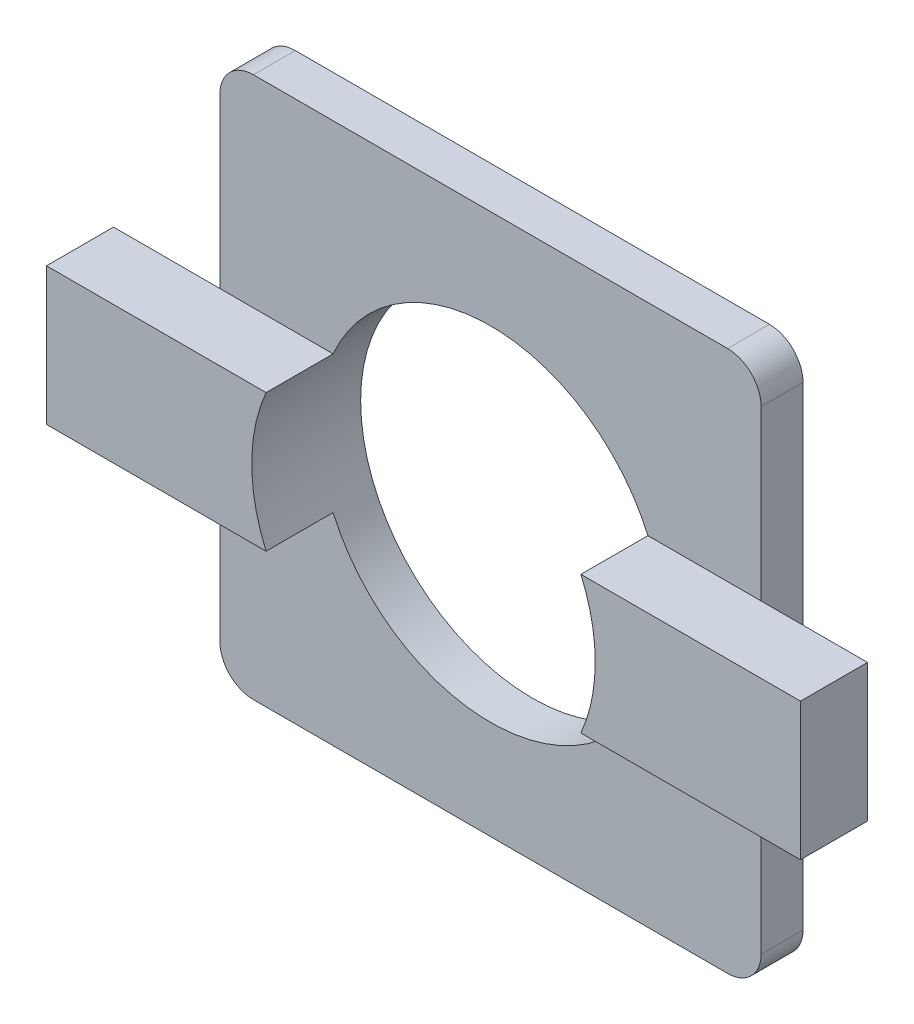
ISO-10303-21;
HEADER;
FILE_DESCRIPTION(('STEP AP214'),'2;1');
FILE_NAME('part.step','',(''),(''),'','','');
FILE_SCHEMA(('AUTOMOTIVE_DESIGN { 1 0 10303 214 1 1 1 1 }'));
ENDSEC;
DATA;
#1=APPLICATION_CONTEXT('core data for automotive mechanical design processes');
#2=APPLICATION_PROTOCOL_DEFINITION('international standard','automotive_design',2000,#1);
#3=PRODUCT_CONTEXT('',#1,'mechanical');
#4=PRODUCT('Part','Part','',(#3));
#5=PRODUCT_RELATED_PRODUCT_CATEGORY('part','',(#4));
#6=PRODUCT_DEFINITION_FORMATION('','',#4);
#7=PRODUCT_DEFINITION_CONTEXT('part definition',#1,'design');
#8=PRODUCT_DEFINITION('design','',#6,#7);
#9=PRODUCT_DEFINITION_SHAPE('','',#8);
#10=(LENGTH_UNIT() NAMED_UNIT(*) SI_UNIT(.MILLI.,.METRE.));
#11=(NAMED_UNIT(*) PLANE_ANGLE_UNIT() SI_UNIT($,.RADIAN.));
#12=(NAMED_UNIT(*) SI_UNIT($,.STERADIAN.) SOLID_ANGLE_UNIT());
#13=UNCERTAINTY_MEASURE_WITH_UNIT(LENGTH_MEASURE(1.E-05),#10,'distance_accuracy_value','');
#14=(GEOMETRIC_REPRESENTATION_CONTEXT(3) GLOBAL_UNCERTAINTY_ASSIGNED_CONTEXT((#13)) GLOBAL_UNIT_ASSIGNED_CONTEXT((#10,
#11,#12)) REPRESENTATION_CONTEXT('',''));
#15=CARTESIAN_POINT('',(0.,0.,0.));
#16=DIRECTION('',(0.,0.,1.));
#17=DIRECTION('',(1.,0.,0.));
#18=AXIS2_PLACEMENT_3D('',#15,#16,#17);
#19=CARTESIAN_POINT('',(22.5,4.1,2.5));
#20=DIRECTION('',(1.,0.,0.));
#21=DIRECTION('',(0.,0.,-1.));
#22=AXIS2_PLACEMENT_3D('',#19,#20,#21);
#23=PLANE('',#22);
#24=DIRECTION('',(0.,1.,0.));
#25=VECTOR('',#24,1.);
#26=CARTESIAN_POINT('',(22.5,0.,2.5));
#27=LINE('',#26,#25);
#28=CARTESIAN_POINT('',(22.5,-4.1,2.5));
#29=VERTEX_POINT('',#28);
#30=CARTESIAN_POINT('',(22.5,4.1,2.5));
#31=VERTEX_POINT('',#30);
#32=EDGE_CURVE('E159',#29,#31,#27,.T.);
#33=ORIENTED_EDGE('',*,*,#32,.T.);
#34=DIRECTION('',(0.,0.,1.));
#35=VECTOR('',#34,1.);
#36=CARTESIAN_POINT('',(22.5,4.1,2.5));
#37=LINE('',#36,#35);
#38=CARTESIAN_POINT('',(22.5,4.1,6.5));
#39=VERTEX_POINT('',#38);
#40=EDGE_CURVE('E147',#39,#31,#37,.F.);
#41=ORIENTED_EDGE('',*,*,#40,.F.);
#42=DIRECTION('',(0.,1.,0.));
#43=VECTOR('',#42,1.);
#44=CARTESIAN_POINT('',(22.5,0.,6.5));
#45=LINE('',#44,#43);
#46=CARTESIAN_POINT('',(22.5,-4.1,6.5));
#47=VERTEX_POINT('',#46);
#48=EDGE_CURVE('E168',#47,#39,#45,.T.);
#49=ORIENTED_EDGE('',*,*,#48,.F.);
#50=DIRECTION('',(0.,0.,-1.));
#51=VECTOR('',#50,1.);
#52=CARTESIAN_POINT('',(22.5,-4.1,2.5));
#53=LINE('',#52,#51);
#54=EDGE_CURVE('E160',#29,#47,#53,.F.);
#55=ORIENTED_EDGE('',*,*,#54,.F.);
#56=EDGE_LOOP('',(#33,#41,#49,#55));
#57=FACE_BOUND('',#56,.T.);
#58=ADVANCED_FACE('F16',(#57),#23,.T.);
#59=CARTESIAN_POINT('',(-22.5,-4.1,2.5));
#60=DIRECTION('',(-1.,0.,0.));
#61=DIRECTION('',(0.,0.,1.));
#62=AXIS2_PLACEMENT_3D('',#59,#60,#61);
#63=PLANE('',#62);
#64=DIRECTION('',(0.,1.,0.));
#65=VECTOR('',#64,1.);
#66=CARTESIAN_POINT('',(-22.5,0.,2.5));
#67=LINE('',#66,#65);
#68=CARTESIAN_POINT('',(-22.5,4.1,2.5));
#69=VERTEX_POINT('',#68);
#70=CARTESIAN_POINT('',(-22.5,-4.1,2.5));
#71=VERTEX_POINT('',#70);
#72=EDGE_CURVE('E161',#69,#71,#67,.F.);
#73=ORIENTED_EDGE('',*,*,#72,.T.);
#74=DIRECTION('',(0.,0.,-1.));
#75=VECTOR('',#74,1.);
#76=CARTESIAN_POINT('',(-22.5,-4.1,2.5));
#77=LINE('',#76,#75);
#78=CARTESIAN_POINT('',(-22.5,-4.1,6.5));
#79=VERTEX_POINT('',#78);
#80=EDGE_CURVE('E255',#79,#71,#77,.T.);
#81=ORIENTED_EDGE('',*,*,#80,.F.);
#82=DIRECTION('',(0.,1.,0.));
#83=VECTOR('',#82,1.);
#84=CARTESIAN_POINT('',(-22.5,0.,6.5));
#85=LINE('',#84,#83);
#86=CARTESIAN_POINT('',(-22.5,4.1,6.5));
#87=VERTEX_POINT('',#86);
#88=EDGE_CURVE('E175',#87,#79,#85,.F.);
#89=ORIENTED_EDGE('',*,*,#88,.F.);
#90=DIRECTION('',(0.,0.,1.));
#91=VECTOR('',#90,1.);
#92=CARTESIAN_POINT('',(-22.5,4.1,2.5));
#93=LINE('',#92,#91);
#94=EDGE_CURVE('E174',#69,#87,#93,.T.);
#95=ORIENTED_EDGE('',*,*,#94,.F.);
#96=EDGE_LOOP('',(#73,#81,#89,#95));
#97=FACE_BOUND('',#96,.T.);
#98=ADVANCED_FACE('F477',(#97),#63,.T.);
#99=CARTESIAN_POINT('',(0.,0.,2.5));
#100=DIRECTION('',(0.,0.,1.));
#101=DIRECTION('',(1.,0.,0.));
#102=AXIS2_PLACEMENT_3D('',#99,#100,#101);
#103=PLANE('',#102);
#104=DIRECTION('',(1.,0.,0.));
#105=VECTOR('',#104,1.);
#106=CARTESIAN_POINT('',(-22.5,4.1,2.5));
#107=LINE('',#106,#105);
#108=CARTESIAN_POINT('',(16.15,4.1,2.5));
#109=VERTEX_POINT('',#108);
#110=EDGE_CURVE('E151',#31,#109,#107,.F.);
#111=ORIENTED_EDGE('',*,*,#110,.F.);
#112=ORIENTED_EDGE('',*,*,#32,.F.);
#113=DIRECTION('',(1.,0.,0.));
#114=VECTOR('',#113,1.);
#115=CARTESIAN_POINT('',(22.5,-4.1,2.5));
#116=LINE('',#115,#114);
#117=CARTESIAN_POINT('',(16.15,-4.1,2.5));
#118=VERTEX_POINT('',#117);
#119=EDGE_CURVE('E115',#118,#29,#116,.T.);
#120=ORIENTED_EDGE('',*,*,#119,.F.);
#121=DIRECTION('',(0.,1.,0.));
#122=VECTOR('',#121,1.);
#123=CARTESIAN_POINT('',(16.15,14.15,2.5));
#124=LINE('',#123,#122);
#125=EDGE_CURVE('E164',#109,#118,#124,.F.);
#126=ORIENTED_EDGE('',*,*,#125,.F.);
#127=EDGE_LOOP('',(#111,#112,#120,#126));
#128=FACE_BOUND('',#127,.T.);
#129=ADVANCED_FACE('F163',(#128),#103,.F.);
#130=CARTESIAN_POINT('',(0.,0.,2.5));
#131=DIRECTION('',(0.,0.,1.));
#132=DIRECTION('',(1.,0.,0.));
#133=AXIS2_PLACEMENT_3D('',#130,#131,#132);
#134=PLANE('',#133);
#135=DIRECTION('',(1.,0.,0.));
#136=VECTOR('',#135,1.);
#137=CARTESIAN_POINT('',(22.5,-4.1,2.5));
#138=LINE('',#137,#136);
#139=CARTESIAN_POINT('',(-16.15,-4.1,2.5));
#140=VERTEX_POINT('',#139);
#141=EDGE_CURVE('E245',#71,#140,#138,.T.);
#142=ORIENTED_EDGE('',*,*,#141,.F.);
#143=ORIENTED_EDGE('',*,*,#72,.F.);
#144=DIRECTION('',(1.,0.,0.));
#145=VECTOR('',#144,1.);
#146=CARTESIAN_POINT('',(-22.5,4.1,2.5));
#147=LINE('',#146,#145);
#148=CARTESIAN_POINT('',(-16.15,4.1,2.5));
#149=VERTEX_POINT('',#148);
#150=EDGE_CURVE('E171',#149,#69,#147,.F.);
#151=ORIENTED_EDGE('',*,*,#150,.F.);
#152=DIRECTION('',(0.,1.,0.));
#153=VECTOR('',#152,1.);
#154=CARTESIAN_POINT('',(-16.15,-14.15,2.5));
#155=LINE('',#154,#153);
#156=EDGE_CURVE('E260',#140,#149,#155,.T.);
#157=ORIENTED_EDGE('',*,*,#156,.F.);
#158=EDGE_LOOP('',(#142,#143,#151,#157));
#159=FACE_BOUND('',#158,.T.);
#160=ADVANCED_FACE('F463',(#159),#134,.F.);
#161=CARTESIAN_POINT('',(0.,0.,6.5));
#162=DIRECTION('',(0.,0.,1.));
#163=DIRECTION('',(1.,0.,0.));
#164=AXIS2_PLACEMENT_3D('',#161,#162,#163);
#165=PLANE('',#164);
#166=ORIENTED_EDGE('',*,*,#88,.T.);
#167=DIRECTION('',(1.,0.,0.));
#168=VECTOR('',#167,1.);
#169=CARTESIAN_POINT('',(22.5,-4.1,6.5));
#170=LINE('',#169,#168);
#171=CARTESIAN_POINT('',(-9.39428017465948,-4.1,6.5));
#172=VERTEX_POINT('',#171);
#173=EDGE_CURVE('E236',#172,#79,#170,.F.);
#174=ORIENTED_EDGE('',*,*,#173,.F.);
#175=CARTESIAN_POINT('',(0.,0.,6.5));
#176=DIRECTION('',(0.,0.,1.));
#177=DIRECTION('',(1.,0.,0.));
#178=AXIS2_PLACEMENT_3D('',#175,#176,#177);
#179=CIRCLE('',#178,10.25);
#180=CARTESIAN_POINT('',(-9.39428017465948,4.1,6.5));
#181=VERTEX_POINT('',#180);
#182=EDGE_CURVE('E205',#172,#181,#179,.F.);
#183=ORIENTED_EDGE('',*,*,#182,.T.);
#184=DIRECTION('',(1.,0.,0.));
#185=VECTOR('',#184,1.);
#186=CARTESIAN_POINT('',(-22.5,4.1,6.5));
#187=LINE('',#186,#185);
#188=EDGE_CURVE('E176',#87,#181,#187,.T.);
#189=ORIENTED_EDGE('',*,*,#188,.F.);
#190=EDGE_LOOP('',(#166,#174,#183,#189));
#191=FACE_BOUND('',#190,.T.);
#192=ADVANCED_FACE('F302',(#191),#165,.T.);
#193=CARTESIAN_POINT('',(-22.5,4.1,2.5));
#194=DIRECTION('',(0.,1.,0.));
#195=DIRECTION('',(0.,0.,1.));
#196=AXIS2_PLACEMENT_3D('',#193,#194,#195);
#197=PLANE('',#196);
#198=ORIENTED_EDGE('',*,*,#94,.T.);
#199=ORIENTED_EDGE('',*,*,#188,.T.);
#200=DIRECTION('',(0.,0.,1.));
#201=VECTOR('',#200,1.);
#202=CARTESIAN_POINT('',(-9.39428017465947,4.1,0.));
#203=LINE('',#202,#201);
#204=CARTESIAN_POINT('',(-9.39428017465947,4.1,2.5));
#205=VERTEX_POINT('',#204);
#206=EDGE_CURVE('E204',#181,#205,#203,.F.);
#207=ORIENTED_EDGE('',*,*,#206,.T.);
#208=DIRECTION('',(1.,0.,0.));
#209=VECTOR('',#208,1.);
#210=CARTESIAN_POINT('',(0.,4.1,2.5));
#211=LINE('',#210,#209);
#212=EDGE_CURVE('E156',#149,#205,#211,.T.);
#213=ORIENTED_EDGE('',*,*,#212,.F.);
#214=ORIENTED_EDGE('',*,*,#150,.T.);
#215=EDGE_LOOP('',(#198,#199,#207,#213,#214));
#216=FACE_BOUND('',#215,.T.);
#217=ADVANCED_FACE('F297',(#216),#197,.T.);
#218=CARTESIAN_POINT('',(0.,0.,2.5));
#219=DIRECTION('',(0.,0.,1.));
#220=DIRECTION('',(1.,0.,0.));
#221=AXIS2_PLACEMENT_3D('',#218,#219,#220);
#222=PLANE('',#221);
#223=DIRECTION('',(0.,1.,0.));
#224=VECTOR('',#223,1.);
#225=CARTESIAN_POINT('',(-16.15,-14.15,2.5));
#226=LINE('',#225,#224);
#227=CARTESIAN_POINT('',(-16.15,14.15,2.5));
#228=VERTEX_POINT('',#227);
#229=EDGE_CURVE('E261',#149,#228,#226,.T.);
#230=ORIENTED_EDGE('',*,*,#229,.F.);
#231=ORIENTED_EDGE('',*,*,#212,.T.);
#232=CARTESIAN_POINT('',(0.,0.,2.5));
#233=DIRECTION('',(0.,0.,1.));
#234=DIRECTION('',(1.,0.,0.));
#235=AXIS2_PLACEMENT_3D('',#232,#233,#234);
#236=CIRCLE('',#235,10.25);
#237=CARTESIAN_POINT('',(9.39428017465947,4.1,2.5));
#238=VERTEX_POINT('',#237);
#239=EDGE_CURVE('E201',#205,#238,#236,.F.);
#240=ORIENTED_EDGE('',*,*,#239,.T.);
#241=DIRECTION('',(1.,0.,0.));
#242=VECTOR('',#241,1.);
#243=CARTESIAN_POINT('',(-22.5,4.1,2.5));
#244=LINE('',#243,#242);
#245=EDGE_CURVE('E166',#109,#238,#244,.F.);
#246=ORIENTED_EDGE('',*,*,#245,.F.);
#247=DIRECTION('',(0.,1.,0.));
#248=VECTOR('',#247,1.);
#249=CARTESIAN_POINT('',(16.15,14.15,2.5));
#250=LINE('',#249,#248);
#251=CARTESIAN_POINT('',(16.15,14.15,2.5));
#252=VERTEX_POINT('',#251);
#253=EDGE_CURVE('E233',#252,#109,#250,.F.);
#254=ORIENTED_EDGE('',*,*,#253,.F.);
#255=CARTESIAN_POINT('',(14.15,14.15,2.5));
#256=DIRECTION('',(0.,0.,1.));
#257=DIRECTION('',(1.,0.,0.));
#258=AXIS2_PLACEMENT_3D('',#255,#256,#257);
#259=CIRCLE('',#258,2.);
#260=CARTESIAN_POINT('',(14.15,16.15,2.5));
#261=VERTEX_POINT('',#260);
#262=EDGE_CURVE('E215',#261,#252,#259,.F.);
#263=ORIENTED_EDGE('',*,*,#262,.F.);
#264=DIRECTION('',(1.,0.,0.));
#265=VECTOR('',#264,1.);
#266=CARTESIAN_POINT('',(-14.15,16.15,2.5));
#267=LINE('',#266,#265);
#268=CARTESIAN_POINT('',(-14.15,16.15,2.5));
#269=VERTEX_POINT('',#268);
#270=EDGE_CURVE('E222',#269,#261,#267,.T.);
#271=ORIENTED_EDGE('',*,*,#270,.F.);
#272=CARTESIAN_POINT('',(-14.15,14.15,2.5));
#273=DIRECTION('',(0.,0.,1.));
#274=DIRECTION('',(1.,0.,0.));
#275=AXIS2_PLACEMENT_3D('',#272,#273,#274);
#276=CIRCLE('',#275,2.);
#277=EDGE_CURVE('E212',#228,#269,#276,.F.);
#278=ORIENTED_EDGE('',*,*,#277,.F.);
#279=EDGE_LOOP('',(#230,#231,#240,#246,#254,#263,#271,#278));
#280=FACE_BOUND('',#279,.T.);
#281=ADVANCED_FACE('F292',(#280),#222,.T.);
#282=CARTESIAN_POINT('',(-22.5,4.1,2.5));
#283=DIRECTION('',(0.,1.,0.));
#284=DIRECTION('',(0.,0.,1.));
#285=AXIS2_PLACEMENT_3D('',#282,#283,#284);
#286=PLANE('',#285);
#287=ORIENTED_EDGE('',*,*,#110,.T.);
#288=ORIENTED_EDGE('',*,*,#245,.T.);
#289=DIRECTION('',(0.,0.,1.));
#290=VECTOR('',#289,1.);
#291=CARTESIAN_POINT('',(9.39428017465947,4.1,0.));
#292=LINE('',#291,#290);
#293=CARTESIAN_POINT('',(9.39428017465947,4.1,6.5));
#294=VERTEX_POINT('',#293);
#295=EDGE_CURVE('E200',#238,#294,#292,.T.);
#296=ORIENTED_EDGE('',*,*,#295,.T.);
#297=DIRECTION('',(1.,0.,0.));
#298=VECTOR('',#297,1.);
#299=CARTESIAN_POINT('',(0.,4.1,6.5));
#300=LINE('',#299,#298);
#301=EDGE_CURVE('E153',#39,#294,#300,.F.);
#302=ORIENTED_EDGE('',*,*,#301,.F.);
#303=ORIENTED_EDGE('',*,*,#40,.T.);
#304=EDGE_LOOP('',(#287,#288,#296,#302,#303));
#305=FACE_BOUND('',#304,.T.);
#306=ADVANCED_FACE('F149',(#305),#286,.T.);
#307=CARTESIAN_POINT('',(0.,0.,6.5));
#308=DIRECTION('',(0.,0.,1.));
#309=DIRECTION('',(1.,0.,0.));
#310=AXIS2_PLACEMENT_3D('',#307,#308,#309);
#311=PLANE('',#310);
#312=ORIENTED_EDGE('',*,*,#48,.T.);
#313=ORIENTED_EDGE('',*,*,#301,.T.);
#314=CARTESIAN_POINT('',(0.,0.,6.5));
#315=DIRECTION('',(0.,0.,1.));
#316=DIRECTION('',(1.,0.,0.));
#317=AXIS2_PLACEMENT_3D('',#314,#315,#316);
#318=CIRCLE('',#317,10.25);
#319=CARTESIAN_POINT('',(9.39428017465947,-4.1,6.5));
#320=VERTEX_POINT('',#319);
#321=EDGE_CURVE('E197',#294,#320,#318,.F.);
#322=ORIENTED_EDGE('',*,*,#321,.T.);
#323=DIRECTION('',(1.,0.,0.));
#324=VECTOR('',#323,1.);
#325=CARTESIAN_POINT('',(22.5,-4.1,6.5));
#326=LINE('',#325,#324);
#327=EDGE_CURVE('E237',#47,#320,#326,.F.);
#328=ORIENTED_EDGE('',*,*,#327,.F.);
#329=EDGE_LOOP('',(#312,#313,#322,#328));
#330=FACE_BOUND('',#329,.T.);
#331=ADVANCED_FACE('F282',(#330),#311,.T.);
#332=CARTESIAN_POINT('',(22.5,-4.1,2.5));
#333=DIRECTION('',(0.,-1.,0.));
#334=DIRECTION('',(0.,0.,-1.));
#335=AXIS2_PLACEMENT_3D('',#332,#333,#334);
#336=PLANE('',#335);
#337=ORIENTED_EDGE('',*,*,#54,.T.);
#338=ORIENTED_EDGE('',*,*,#327,.T.);
#339=DIRECTION('',(0.,0.,1.));
#340=VECTOR('',#339,1.);
#341=CARTESIAN_POINT('',(9.39428017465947,-4.1,0.));
#342=LINE('',#341,#340);
#343=CARTESIAN_POINT('',(9.39428017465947,-4.1,2.5));
#344=VERTEX_POINT('',#343);
#345=EDGE_CURVE('E196',#320,#344,#342,.F.);
#346=ORIENTED_EDGE('',*,*,#345,.T.);
#347=DIRECTION('',(1.,0.,0.));
#348=VECTOR('',#347,1.);
#349=CARTESIAN_POINT('',(0.,-4.1,2.5));
#350=LINE('',#349,#348);
#351=EDGE_CURVE('E234',#118,#344,#350,.F.);
#352=ORIENTED_EDGE('',*,*,#351,.F.);
#353=ORIENTED_EDGE('',*,*,#119,.T.);
#354=EDGE_LOOP('',(#337,#338,#346,#352,#353));
#355=FACE_BOUND('',#354,.T.);
#356=ADVANCED_FACE('F277',(#355),#336,.T.);
#357=CARTESIAN_POINT('',(0.,0.,2.5));
#358=DIRECTION('',(0.,0.,1.));
#359=DIRECTION('',(1.,0.,0.));
#360=AXIS2_PLACEMENT_3D('',#357,#358,#359);
#361=PLANE('',#360);
#362=DIRECTION('',(0.,1.,0.));
#363=VECTOR('',#362,1.);
#364=CARTESIAN_POINT('',(16.15,14.15,2.5));
#365=LINE('',#364,#363);
#366=CARTESIAN_POINT('',(16.15,-14.15,2.5));
#367=VERTEX_POINT('',#366);
#368=EDGE_CURVE('E107',#118,#367,#365,.F.);
#369=ORIENTED_EDGE('',*,*,#368,.F.);
#370=ORIENTED_EDGE('',*,*,#351,.T.);
#371=CARTESIAN_POINT('',(0.,0.,2.5));
#372=DIRECTION('',(0.,0.,1.));
#373=DIRECTION('',(1.,0.,0.));
#374=AXIS2_PLACEMENT_3D('',#371,#372,#373);
#375=CIRCLE('',#374,10.25);
#376=CARTESIAN_POINT('',(-9.39428017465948,-4.1,2.5));
#377=VERTEX_POINT('',#376);
#378=EDGE_CURVE('E192',#344,#377,#375,.F.);
#379=ORIENTED_EDGE('',*,*,#378,.T.);
#380=DIRECTION('',(1.,0.,0.));
#381=VECTOR('',#380,1.);
#382=CARTESIAN_POINT('',(22.5,-4.1,2.5));
#383=LINE('',#382,#381);
#384=EDGE_CURVE('E242',#140,#377,#383,.T.);
#385=ORIENTED_EDGE('',*,*,#384,.F.);
#386=DIRECTION('',(0.,1.,0.));
#387=VECTOR('',#386,1.);
#388=CARTESIAN_POINT('',(-16.15,-14.15,2.5));
#389=LINE('',#388,#387);
#390=CARTESIAN_POINT('',(-16.15,-14.15,2.5));
#391=VERTEX_POINT('',#390);
#392=EDGE_CURVE('E257',#391,#140,#389,.T.);
#393=ORIENTED_EDGE('',*,*,#392,.F.);
#394=CARTESIAN_POINT('',(-14.15,-14.15,2.5));
#395=DIRECTION('',(0.,0.,1.));
#396=DIRECTION('',(1.,0.,0.));
#397=AXIS2_PLACEMENT_3D('',#394,#395,#396);
#398=CIRCLE('',#397,1.99999999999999);
#399=CARTESIAN_POINT('',(-14.15,-16.15,2.5));
#400=VERTEX_POINT('',#399);
#401=EDGE_CURVE('E209',#400,#391,#398,.F.);
#402=ORIENTED_EDGE('',*,*,#401,.F.);
#403=DIRECTION('',(1.,0.,0.));
#404=VECTOR('',#403,1.);
#405=CARTESIAN_POINT('',(14.15,-16.15,2.5));
#406=LINE('',#405,#404);
#407=CARTESIAN_POINT('',(14.15,-16.15,2.5));
#408=VERTEX_POINT('',#407);
#409=EDGE_CURVE('E244',#408,#400,#406,.F.);
#410=ORIENTED_EDGE('',*,*,#409,.F.);
#411=CARTESIAN_POINT('',(14.15,-14.15,2.5));
#412=DIRECTION('',(0.,0.,1.));
#413=DIRECTION('',(1.,0.,0.));
#414=AXIS2_PLACEMENT_3D('',#411,#412,#413);
#415=CIRCLE('',#414,2.00000000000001);
#416=EDGE_CURVE('E19',#367,#408,#415,.F.);
#417=ORIENTED_EDGE('',*,*,#416,.F.);
#418=EDGE_LOOP('',(#369,#370,#379,#385,#393,#402,#410,#417));
#419=FACE_BOUND('',#418,.T.);
#420=ADVANCED_FACE('F308',(#419),#361,.T.);
#421=CARTESIAN_POINT('',(22.5,-4.1,2.5));
#422=DIRECTION('',(0.,-1.,0.));
#423=DIRECTION('',(0.,0.,-1.));
#424=AXIS2_PLACEMENT_3D('',#421,#422,#423);
#425=PLANE('',#424);
#426=ORIENTED_EDGE('',*,*,#141,.T.);
#427=ORIENTED_EDGE('',*,*,#384,.T.);
#428=DIRECTION('',(0.,0.,1.));
#429=VECTOR('',#428,1.);
#430=CARTESIAN_POINT('',(-9.39428017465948,-4.1,0.));
#431=LINE('',#430,#429);
#432=EDGE_CURVE('E195',#377,#172,#431,.T.);
#433=ORIENTED_EDGE('',*,*,#432,.T.);
#434=ORIENTED_EDGE('',*,*,#173,.T.);
#435=ORIENTED_EDGE('',*,*,#80,.T.);
#436=EDGE_LOOP('',(#426,#427,#433,#434,#435));
#437=FACE_BOUND('',#436,.T.);
#438=ADVANCED_FACE('F414',(#437),#425,.T.);
#439=CARTESIAN_POINT('',(14.15,-16.15,0.));
#440=DIRECTION('',(0.,-1.,0.));
#441=DIRECTION('',(0.,0.,-1.));
#442=AXIS2_PLACEMENT_3D('',#439,#440,#441);
#443=PLANE('',#442);
#444=DIRECTION('',(1.,0.,0.));
#445=VECTOR('',#444,1.);
#446=CARTESIAN_POINT('',(0.,-16.15,0.));
#447=LINE('',#446,#445);
#448=CARTESIAN_POINT('',(-14.15,-16.15,0.));
#449=VERTEX_POINT('',#448);
#450=CARTESIAN_POINT('',(14.15,-16.15,0.));
#451=VERTEX_POINT('',#450);
#452=EDGE_CURVE('E191',#449,#451,#447,.T.);
#453=ORIENTED_EDGE('',*,*,#452,.T.);
#454=DIRECTION('',(0.,0.,1.));
#455=VECTOR('',#454,1.);
#456=CARTESIAN_POINT('',(14.15,-16.15,0.));
#457=LINE('',#456,#455);
#458=EDGE_CURVE('E231',#408,#451,#457,.F.);
#459=ORIENTED_EDGE('',*,*,#458,.F.);
#460=ORIENTED_EDGE('',*,*,#409,.T.);
#461=DIRECTION('',(0.,0.,1.));
#462=VECTOR('',#461,1.);
#463=CARTESIAN_POINT('',(-14.15,-16.15,0.));
#464=LINE('',#463,#462);
#465=EDGE_CURVE('E208',#449,#400,#464,.T.);
#466=ORIENTED_EDGE('',*,*,#465,.F.);
#467=EDGE_LOOP('',(#453,#459,#460,#466));
#468=FACE_BOUND('',#467,.T.);
#469=ADVANCED_FACE('F323',(#468),#443,.T.);
#470=CARTESIAN_POINT('',(14.15,-14.15,0.));
#471=DIRECTION('',(0.,0.,1.));
#472=DIRECTION('',(1.,0.,0.));
#473=AXIS2_PLACEMENT_3D('',#470,#471,#472);
#474=CYLINDRICAL_SURFACE('',#473,2.00000000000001);
#475=CARTESIAN_POINT('',(14.15,-14.15,0.));
#476=DIRECTION('',(0.,0.,1.));
#477=DIRECTION('',(1.,0.,0.));
#478=AXIS2_PLACEMENT_3D('',#475,#476,#477);
#479=CIRCLE('',#478,2.00000000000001);
#480=CARTESIAN_POINT('',(16.15,-14.15,0.));
#481=VERTEX_POINT('',#480);
#482=EDGE_CURVE('E188',#451,#481,#479,.T.);
#483=ORIENTED_EDGE('',*,*,#482,.T.);
#484=DIRECTION('',(0.,0.,-1.));
#485=VECTOR('',#484,1.);
#486=CARTESIAN_POINT('',(16.15,-14.15,0.));
#487=LINE('',#486,#485);
#488=EDGE_CURVE('E217',#367,#481,#487,.T.);
#489=ORIENTED_EDGE('',*,*,#488,.F.);
#490=ORIENTED_EDGE('',*,*,#416,.T.);
#491=ORIENTED_EDGE('',*,*,#458,.T.);
#492=EDGE_LOOP('',(#483,#489,#490,#491));
#493=FACE_BOUND('',#492,.T.);
#494=ADVANCED_FACE('F314',(#493),#474,.T.);
#495=CARTESIAN_POINT('',(16.15,14.15,0.));
#496=DIRECTION('',(1.,0.,0.));
#497=DIRECTION('',(0.,0.,-1.));
#498=AXIS2_PLACEMENT_3D('',#495,#496,#497);
#499=PLANE('',#498);
#500=DIRECTION('',(0.,1.,0.));
#501=VECTOR('',#500,1.);
#502=CARTESIAN_POINT('',(16.15,0.,0.));
#503=LINE('',#502,#501);
#504=CARTESIAN_POINT('',(16.15,14.15,0.));
#505=VERTEX_POINT('',#504);
#506=EDGE_CURVE('E187',#481,#505,#503,.T.);
#507=ORIENTED_EDGE('',*,*,#506,.T.);
#508=DIRECTION('',(0.,0.,1.));
#509=VECTOR('',#508,1.);
#510=CARTESIAN_POINT('',(16.15,14.15,0.));
#511=LINE('',#510,#509);
#512=EDGE_CURVE('E216',#252,#505,#511,.F.);
#513=ORIENTED_EDGE('',*,*,#512,.F.);
#514=ORIENTED_EDGE('',*,*,#253,.T.);
#515=ORIENTED_EDGE('',*,*,#125,.T.);
#516=ORIENTED_EDGE('',*,*,#368,.T.);
#517=ORIENTED_EDGE('',*,*,#488,.T.);
#518=EDGE_LOOP('',(#507,#513,#514,#515,#516,#517));
#519=FACE_BOUND('',#518,.T.);
#520=ADVANCED_FACE('F340',(#519),#499,.T.);
#521=CARTESIAN_POINT('',(14.15,14.15,0.));
#522=DIRECTION('',(0.,0.,1.));
#523=DIRECTION('',(1.,0.,0.));
#524=AXIS2_PLACEMENT_3D('',#521,#522,#523);
#525=CYLINDRICAL_SURFACE('',#524,2.);
#526=CARTESIAN_POINT('',(14.15,14.15,0.));
#527=DIRECTION('',(0.,0.,1.));
#528=DIRECTION('',(1.,0.,0.));
#529=AXIS2_PLACEMENT_3D('',#526,#527,#528);
#530=CIRCLE('',#529,2.);
#531=CARTESIAN_POINT('',(14.15,16.15,0.));
#532=VERTEX_POINT('',#531);
#533=EDGE_CURVE('E184',#505,#532,#530,.T.);
#534=ORIENTED_EDGE('',*,*,#533,.T.);
#535=DIRECTION('',(0.,0.,1.));
#536=VECTOR('',#535,1.);
#537=CARTESIAN_POINT('',(14.15,16.15,0.));
#538=LINE('',#537,#536);
#539=EDGE_CURVE('E214',#261,#532,#538,.F.);
#540=ORIENTED_EDGE('',*,*,#539,.F.);
#541=ORIENTED_EDGE('',*,*,#262,.T.);
#542=ORIENTED_EDGE('',*,*,#512,.T.);
#543=EDGE_LOOP('',(#534,#540,#541,#542));
#544=FACE_BOUND('',#543,.T.);
#545=ADVANCED_FACE('F339',(#544),#525,.T.);
#546=CARTESIAN_POINT('',(-14.15,16.15,0.));
#547=DIRECTION('',(0.,1.,0.));
#548=DIRECTION('',(0.,0.,1.));
#549=AXIS2_PLACEMENT_3D('',#546,#547,#548);
#550=PLANE('',#549);
#551=DIRECTION('',(1.,0.,0.));
#552=VECTOR('',#551,1.);
#553=CARTESIAN_POINT('',(0.,16.15,0.));
#554=LINE('',#553,#552);
#555=CARTESIAN_POINT('',(-14.15,16.15,0.));
#556=VERTEX_POINT('',#555);
#557=EDGE_CURVE('E183',#532,#556,#554,.F.);
#558=ORIENTED_EDGE('',*,*,#557,.T.);
#559=DIRECTION('',(0.,0.,1.));
#560=VECTOR('',#559,1.);
#561=CARTESIAN_POINT('',(-14.15,16.15,0.));
#562=LINE('',#561,#560);
#563=EDGE_CURVE('E213',#269,#556,#562,.F.);
#564=ORIENTED_EDGE('',*,*,#563,.F.);
#565=ORIENTED_EDGE('',*,*,#270,.T.);
#566=ORIENTED_EDGE('',*,*,#539,.T.);
#567=EDGE_LOOP('',(#558,#564,#565,#566));
#568=FACE_BOUND('',#567,.T.);
#569=ADVANCED_FACE('F335',(#568),#550,.T.);
#570=CARTESIAN_POINT('',(-14.15,14.15,0.));
#571=DIRECTION('',(0.,0.,1.));
#572=DIRECTION('',(1.,0.,0.));
#573=AXIS2_PLACEMENT_3D('',#570,#571,#572);
#574=CYLINDRICAL_SURFACE('',#573,2.);
#575=CARTESIAN_POINT('',(-14.15,14.15,0.));
#576=DIRECTION('',(0.,0.,1.));
#577=DIRECTION('',(1.,0.,0.));
#578=AXIS2_PLACEMENT_3D('',#575,#576,#577);
#579=CIRCLE('',#578,2.);
#580=CARTESIAN_POINT('',(-16.15,14.15,0.));
#581=VERTEX_POINT('',#580);
#582=EDGE_CURVE('E180',#556,#581,#579,.T.);
#583=ORIENTED_EDGE('',*,*,#582,.T.);
#584=DIRECTION('',(0.,0.,1.));
#585=VECTOR('',#584,1.);
#586=CARTESIAN_POINT('',(-16.15,14.15,0.));
#587=LINE('',#586,#585);
#588=EDGE_CURVE('E211',#228,#581,#587,.F.);
#589=ORIENTED_EDGE('',*,*,#588,.F.);
#590=ORIENTED_EDGE('',*,*,#277,.T.);
#591=ORIENTED_EDGE('',*,*,#563,.T.);
#592=EDGE_LOOP('',(#583,#589,#590,#591));
#593=FACE_BOUND('',#592,.T.);
#594=ADVANCED_FACE('F366',(#593),#574,.T.);
#595=CARTESIAN_POINT('',(-16.15,-14.15,0.));
#596=DIRECTION('',(-1.,0.,0.));
#597=DIRECTION('',(0.,0.,1.));
#598=AXIS2_PLACEMENT_3D('',#595,#596,#597);
#599=PLANE('',#598);
#600=DIRECTION('',(0.,1.,0.));
#601=VECTOR('',#600,1.);
#602=CARTESIAN_POINT('',(-16.15,0.,0.));
#603=LINE('',#602,#601);
#604=CARTESIAN_POINT('',(-16.15,-14.15,0.));
#605=VERTEX_POINT('',#604);
#606=EDGE_CURVE('E179',#581,#605,#603,.F.);
#607=ORIENTED_EDGE('',*,*,#606,.T.);
#608=DIRECTION('',(0.,0.,1.));
#609=VECTOR('',#608,1.);
#610=CARTESIAN_POINT('',(-16.15,-14.15,0.));
#611=LINE('',#610,#609);
#612=EDGE_CURVE('E34',#391,#605,#611,.F.);
#613=ORIENTED_EDGE('',*,*,#612,.F.);
#614=ORIENTED_EDGE('',*,*,#392,.T.);
#615=ORIENTED_EDGE('',*,*,#156,.T.);
#616=ORIENTED_EDGE('',*,*,#229,.T.);
#617=ORIENTED_EDGE('',*,*,#588,.T.);
#618=EDGE_LOOP('',(#607,#613,#614,#615,#616,#617));
#619=FACE_BOUND('',#618,.T.);
#620=ADVANCED_FACE('F363',(#619),#599,.T.);
#621=CARTESIAN_POINT('',(-14.15,-14.15,0.));
#622=DIRECTION('',(0.,0.,1.));
#623=DIRECTION('',(1.,0.,0.));
#624=AXIS2_PLACEMENT_3D('',#621,#622,#623);
#625=CYLINDRICAL_SURFACE('',#624,1.99999999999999);
#626=CARTESIAN_POINT('',(-14.15,-14.15,0.));
#627=DIRECTION('',(0.,0.,1.));
#628=DIRECTION('',(1.,0.,0.));
#629=AXIS2_PLACEMENT_3D('',#626,#627,#628);
#630=CIRCLE('',#629,1.99999999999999);
#631=EDGE_CURVE('E25',#605,#449,#630,.T.);
#632=ORIENTED_EDGE('',*,*,#631,.T.);
#633=ORIENTED_EDGE('',*,*,#465,.T.);
#634=ORIENTED_EDGE('',*,*,#401,.T.);
#635=ORIENTED_EDGE('',*,*,#612,.T.);
#636=EDGE_LOOP('',(#632,#633,#634,#635));
#637=FACE_BOUND('',#636,.T.);
#638=ADVANCED_FACE('F356',(#637),#625,.T.);
#639=CARTESIAN_POINT('',(0.,0.,0.));
#640=DIRECTION('',(0.,0.,1.));
#641=DIRECTION('',(1.,0.,0.));
#642=AXIS2_PLACEMENT_3D('',#639,#640,#641);
#643=CYLINDRICAL_SURFACE('',#642,10.25);
#644=CARTESIAN_POINT('',(0.,0.,0.));
#645=DIRECTION('',(0.,0.,1.));
#646=DIRECTION('',(1.,0.,0.));
#647=AXIS2_PLACEMENT_3D('',#644,#645,#646);
#648=CIRCLE('',#647,10.25);
#649=CARTESIAN_POINT('',(10.25,0.,0.));
#650=VERTEX_POINT('',#649);
#651=EDGE_CURVE('E11',#650,#650,#648,.F.);
#652=ORIENTED_EDGE('',*,*,#651,.T.);
#653=EDGE_LOOP('',(#652));
#654=FACE_BOUND('',#653,.T.);
#655=ORIENTED_EDGE('',*,*,#378,.F.);
#656=ORIENTED_EDGE('',*,*,#345,.F.);
#657=ORIENTED_EDGE('',*,*,#321,.F.);
#658=ORIENTED_EDGE('',*,*,#295,.F.);
#659=ORIENTED_EDGE('',*,*,#239,.F.);
#660=ORIENTED_EDGE('',*,*,#206,.F.);
#661=ORIENTED_EDGE('',*,*,#182,.F.);
#662=ORIENTED_EDGE('',*,*,#432,.F.);
#663=EDGE_LOOP('',(#655,#656,#657,#658,#659,#660,#661,#662));
#664=FACE_BOUND('',#663,.T.);
#665=ADVANCED_FACE('F287',(#654,#664),#643,.F.);
#666=CARTESIAN_POINT('',(0.,0.,0.));
#667=DIRECTION('',(0.,0.,1.));
#668=DIRECTION('',(1.,0.,0.));
#669=AXIS2_PLACEMENT_3D('',#666,#667,#668);
#670=PLANE('',#669);
#671=ORIENTED_EDGE('',*,*,#651,.F.);
#672=EDGE_LOOP('',(#671));
#673=FACE_BOUND('',#672,.T.);
#674=ORIENTED_EDGE('',*,*,#606,.F.);
#675=ORIENTED_EDGE('',*,*,#582,.F.);
#676=ORIENTED_EDGE('',*,*,#557,.F.);
#677=ORIENTED_EDGE('',*,*,#533,.F.);
#678=ORIENTED_EDGE('',*,*,#506,.F.);
#679=ORIENTED_EDGE('',*,*,#482,.F.);
#680=ORIENTED_EDGE('',*,*,#452,.F.);
#681=ORIENTED_EDGE('',*,*,#631,.F.);
#682=EDGE_LOOP('',(#674,#675,#676,#677,#678,#679,#680,#681));
#683=FACE_BOUND('',#682,.T.);
#684=ADVANCED_FACE('F319',(#673,#683),#670,.F.);
#685=CLOSED_SHELL('',(#58,#98,#129,#160,#192,#217,#281,#306,#331,#356,#420,#438,#469,#494,#520,
#545,#569,#594,#620,#638,#665,#684));
#686=MANIFOLD_SOLID_BREP('B1',#685);
#687=ADVANCED_BREP_SHAPE_REPRESENTATION('',(#18,#686),#14);
#688=SHAPE_DEFINITION_REPRESENTATION(#9,#687);
ENDSEC;
END-ISO-10303-21;
